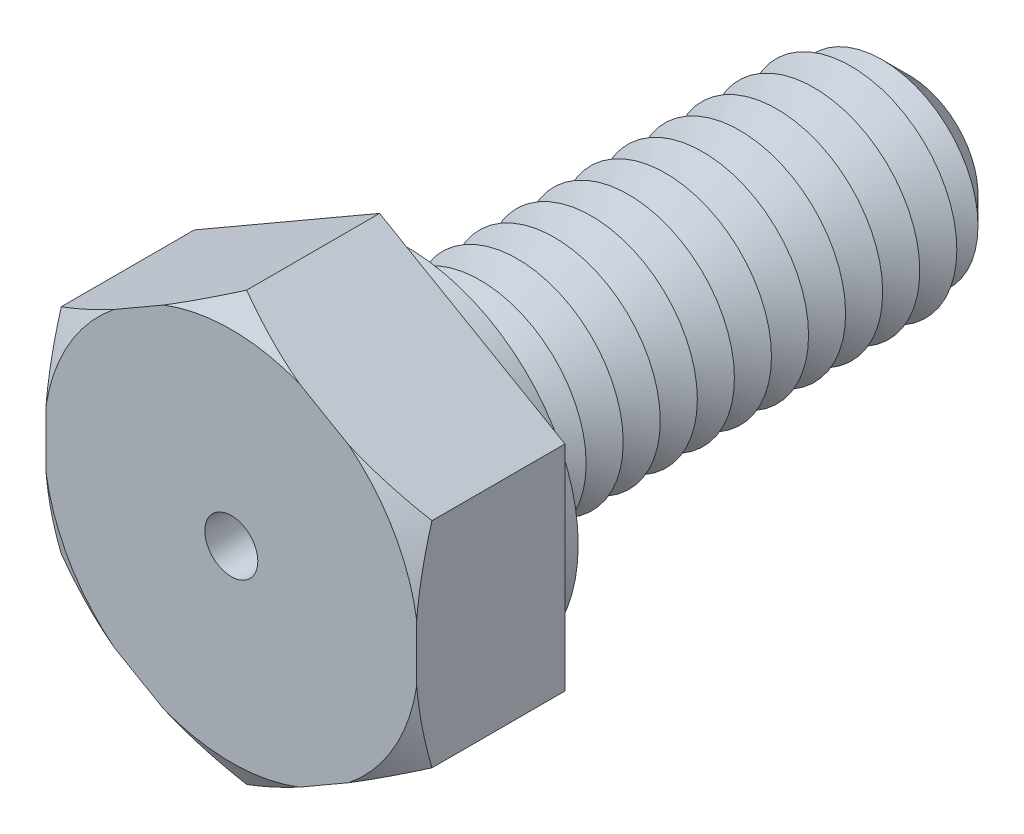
from build123d import *

# Parameters (mm, degrees)
BOSS_EXTRUDE1_DEPTH = 2.8
SKETCH3_R           = 2
BOSS_EXTRUDE2_DEPTH = 10
SKETCH4_R           = 3.25
BOSS_EXTRUDE3_DEPTH = 0.5
CHAMFER1_SIZE       = 0.7
LPATTERN1_COUNT     = 13
LPATTERN1_PITCH     = 0.7
SKETCH8_R           = 0.5
CUT_EXTRUDE1_DEPTH  = 12.8


with BuildPart() as part:
    # Sketch2 → Boss-Extrude1 (new body)
    with BuildSketch(Plane.XY):
        Polygon((0, 4.041451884), (-3.5, 2.020725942), (-3.5, -2.020725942), (0, -4.041451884), (3.5, -2.020725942), (3.5, 2.020725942), align=None)
    extrude(amount=BOSS_EXTRUDE1_DEPTH)

    # Sketch3 → Boss-Extrude2 (add)
    with BuildSketch(Plane(origin=(0, 0, 0), x_dir=(-1, 0, 0), z_dir=(0, 0, -1))):
        Circle(SKETCH3_R)
    extrude(amount=BOSS_EXTRUDE2_DEPTH)

    # Sketch4 → Boss-Extrude3 (add)
    with BuildSketch(Plane(origin=(0, 0, 0), x_dir=(-1, 0, 0), z_dir=(0, 0, -1))):
        with Locations(Location((0, 0, 0), (0, 0, 180))):
            Circle(SKETCH4_R)
    extrude(amount=BOSS_EXTRUDE3_DEPTH)

    # Chamfer1
    chamfer1_edges = [part.edges().sort_by_distance(p)[0] for p in [
        (2, 0, -10),
    ]]
    chamfer(chamfer1_edges, length=CHAMFER1_SIZE)

    # Sketch6 → Cut-Revolve1 (revolve, cut)
    with BuildSketch(Plane(origin=(0, 0, 0), x_dir=(0, 0, -1), z_dir=(1, 0, 0)), mode=Mode.PRIVATE) as cut_revolve1_sk:
        Polygon((0.5, 2), (0.85, 1.393782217), (1.2, 2), align=None)
    cut_revolve1 = revolve(cut_revolve1_sk.sketch.rotate(Axis((0, 0, 3.211670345), (0, 0, -1)), 90), axis=Axis((0, 0, 3.211670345), (0, 0, -1)), mode=Mode.SUBTRACT)

    # LPattern1: Cut-Revolve1 ×13
    with Locations(*[(0, 0, -i * LPATTERN1_PITCH) for i in range(1, LPATTERN1_COUNT)]):
        add(cut_revolve1, mode=Mode.SUBTRACT)

    # Sketch7 → Cut-Revolve2 (revolve, cut)
    with BuildSketch(Plane(origin=(0, 0, 0), x_dir=(0, 0, -1), z_dir=(1, 0, 0)), mode=Mode.PRIVATE) as cut_revolve2_sk:
        Polygon((-2.8, 4.041451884), (-2.8, 3.541451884), (-2.511324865, 4.041451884), align=None)
    revolve(cut_revolve2_sk.sketch.rotate(Axis((0, 0, 3.211670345), (0, 0, -1)), 270), axis=Axis((0, 0, 3.211670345), (0, 0, -1)), mode=Mode.SUBTRACT)

    # Sketch8 → Cut-Extrude1 (cut)
    with BuildSketch(Plane.XY.offset(2.8)):
        Circle(SKETCH8_R)
    extrude(amount=-CUT_EXTRUDE1_DEPTH, mode=Mode.SUBTRACT)


solid = part.part
